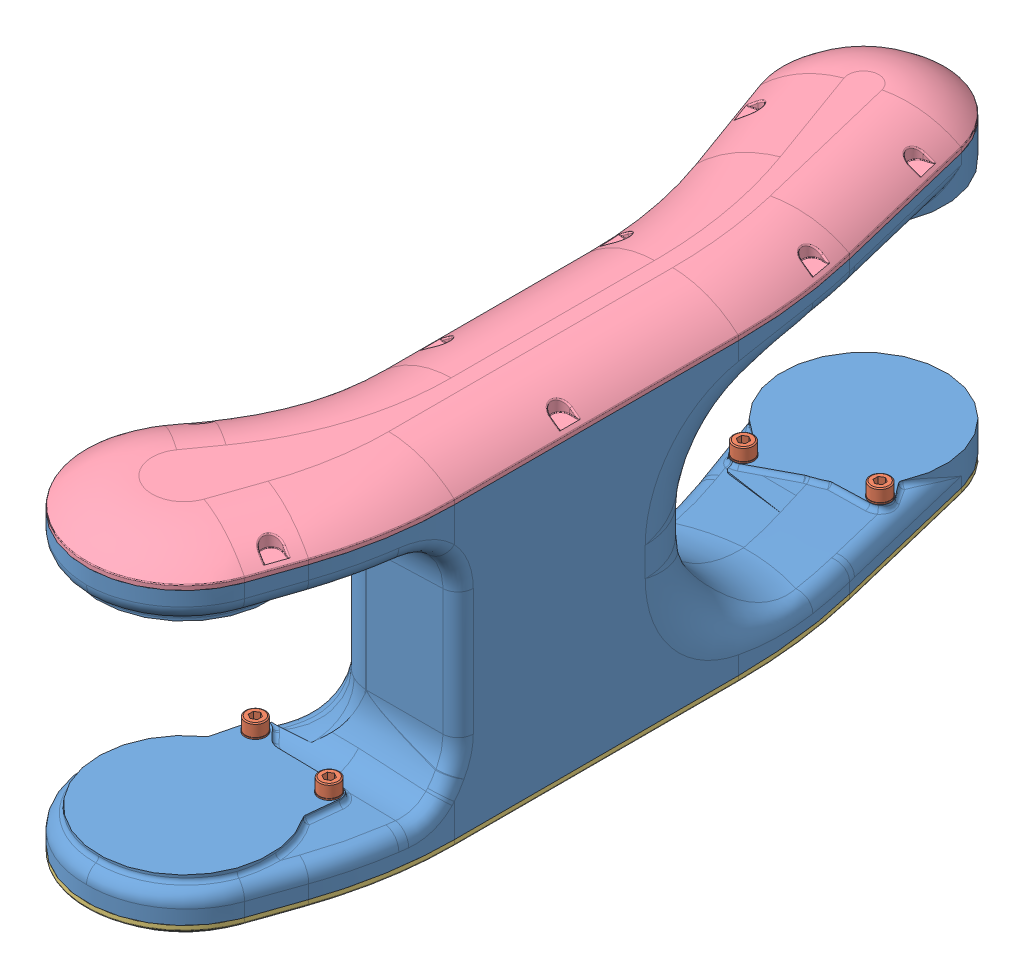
SolidWorks assembly GP7_L_AXIS.sldasm, configuration Default (file format 13000). Lengths in mm.
Overall size (233.56 273.26 562.73).
7 component instances, 4 part files, 6 mates.
Components (placement in the parent):
- L_ARM-1: L_ARM.SLDPRT [Default] at origin size (233.56 273.26 562.73)
- KU6BOLT_M8X16_SS_SSW-1: KU6BOLT_M8X16_SS_SSW.sldprt [Default] at (39.9694 -71.1 -55.0132) size (13.5 24 13.5)
- KU6BOLT_M8X16_SS_SSW-7: KU6BOLT_M8X16_SS_SSW.sldprt [Default] at (-18.4194 -74.1 -384.7528) size (13.5 24 13.5)
- KU6BOLT_M8X16_SS_SSW-6: KU6BOLT_M8X16_SS_SSW.sldprt [Default] at (49.6447 -74.1 -406.2133) size (13.5 24 13.5)
- KU6BOLT_M8X16_SS_SSW-5: KU6BOLT_M8X16_SS_SSW.sldprt [Default] at (-18.7433 -71.1 -65.3658) size (13.5 24 13.5)
- L_ARM_COVER-1: L_ARM_COVER.SLDPRT [Default] at (0 -95 -222.5) x (-1 0 0) z (0 0 1) size (149 20 562)
- L_ARM_COVER2-2: L_ARM_COVER2.SLDPRT [Default] at (0 95 -222.5) x (-1 0 0) z (0 0 -1) size (149 20 562)
Mates (geometry in assembly coordinates):
- Concentric1: concentric anti-aligned: cylinder of HW1100931_L_ARM-1 through (-18.7433 -265.7349 -65.3658) axis (0 1 0) radius 7.5; cylinder of KU6BOLT_M8X16_SS_SSW-5 through (-18.7433 -61.9 -65.3658) axis (0 -1 0) radius 4
- Coincident1: coincident anti-aligned: plane of HW1100931_L_ARM-1 through (100 -72 -76.04) normal (0 1 0); plane of KU6BOLT_M8X16_SS_SSW-5 through (-18.7433 -72 -65.3658) normal (0 -1 0)
- Concentric2: concentric anti-aligned: cylinder of HW1100931_L_ARM-1 through (-18.4194 -240.2309 -384.7528) axis (0 1 0) radius 7; cylinder of KU6BOLT_M8X16_SS_SSW-7 through (-18.4194 -64.9 -384.7528) axis (0 -1 0) radius 4
- Coincident2: coincident anti-aligned: plane of HW1100931_L_ARM-1 through (0 -75 -445) normal (0 1 0); plane of KU6BOLT_M8X16_SS_SSW-7 through (-18.4194 -75 -384.7528) normal (0 -1 0)
- Concentric3: concentric anti-aligned: cylinder of HW1100931_L_ARM-1 through (49.6447 -240.2309 -406.2133) axis (0 1 0) radius 7; cylinder of KU6BOLT_M8X16_SS_SSW-6 through (49.6447 -64.9 -406.2133) axis (0 -1 0) radius 4
- Coincident3: coincident anti-aligned: plane of HW1100931_L_ARM-1 through (0 -75 -445) normal (0 1 0); plane of KU6BOLT_M8X16_SS_SSW-6 through (49.6447 -75 -406.2133) normal (0 -1 0)
